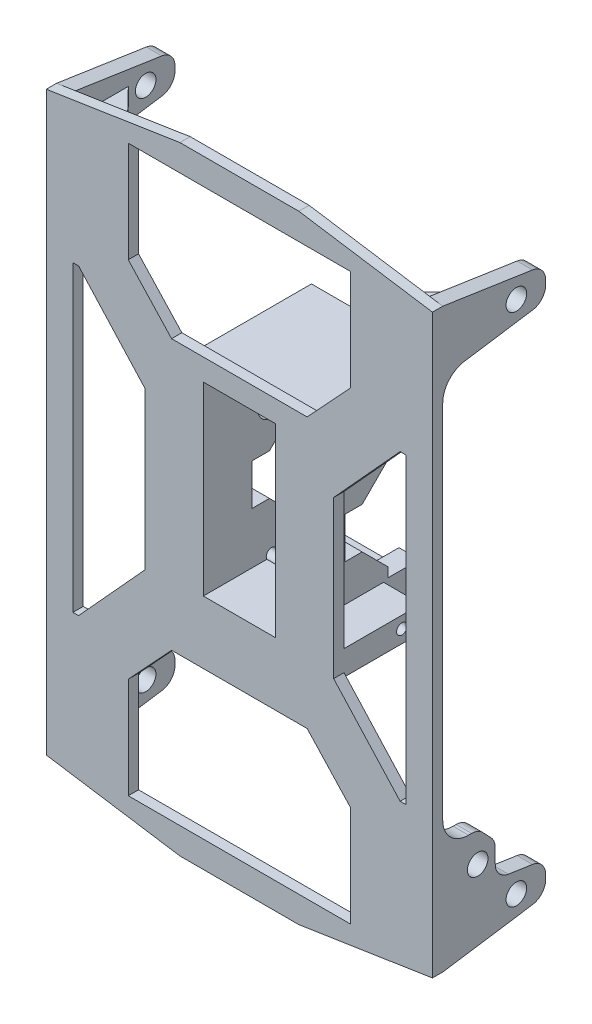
from build123d import *

# Parameters (mm, degrees)
ESQUISSE1_W              = 75
ESQUISSE1_H              = 120
BOSS_EXTRU_1_DEPTH       = 2
BOSS_EXTRU_2_DEPTH       = 3
BOSS_EXTRU_3_DEPTH       = 22
ESQUISSE5_W              = 15
ESQUISSE5_H              = 8
ENL_V_MAT_EXTRU_1_DEPTH  = 132.286899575
ESQUISSE6_R              = 2.644924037
ENL_V_MAT_EXTRU_2_DEPTH  = 22
ESQUISSE7_R              = 1.5
ENL_V_MAT_EXTRU_3_DEPTH  = 22
BOSS_EXTRU_4_DEPTH       = 3
ESQUISSE9_R              = 2
ENL_V_MAT_EXTRU_4_DEPTH  = 144.209636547
ESQUISSE10_R             = 2
ENL_V_MAT_EXTRU_5_DEPTH  = 6
ENL_V_MAT_EXTRU_6_DEPTH  = 132.286899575
BOSS_EXTRU_5_DEPTH       = 1.5
BOSS_EXTRU_6_DEPTH       = 1.5
CONG_1_R                 = 5
ENL_V_MAT_EXTRU_7_DEPTH  = 3
ESQUISSE15_W             = 14
ESQUISSE15_H             = 36
ENL_V_MAT_EXTRU_8_DEPTH  = 128.99316388
CHANFREIN1_SIZE          = 5
ESQUISSE16_W             = 7.311306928
ESQUISSE16_H             = 4.807615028
BOSS_EXTRU_7_DEPTH       = 15
ESQUISSE18_R             = 1.03
ENL_V_MAT_EXTRU_9_DEPTH  = 135.159986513
CONG_2_R                 = 3
ENL_V_MAT_EXTRU_10_DEPTH = 128.633263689
BOSS_EXTRU_8_DEPTH       = 1


with BuildPart() as part:
    # Esquisse1 → Boss.-Extru.1 (new body)
    with BuildSketch(Plane.XY):
        with Locations((0, 60)):
            Rectangle(ESQUISSE1_W, ESQUISSE1_H)
    extrude(amount=BOSS_EXTRU_1_DEPTH)

    # Esquisse2 → Boss.-Extru.2 (add)
    with BuildSketch(Plane.ZY.offset(37.5)):
        Polygon((0, 116), (-20, 113), (-20, 107), (0, 104), align=None)
        Polygon((0, 16), (0, 4), (-20, 7), (-20, 13), align=None)
    boss_extru_2 = extrude(amount=-BOSS_EXTRU_2_DEPTH)

    # Esquisse4 → Boss.-Extru.3 (add)
    with BuildSketch(Plane(origin=(0, 0, 0), x_dir=(-1, 0, 0), z_dir=(0, 0, -1))):
        Polygon((11, 49), (11, 44), (-11, 44), (-11, 49), (-11, 84), (11, 84), align=None)
    extrude(amount=BOSS_EXTRU_3_DEPTH)

    # Esquisse5 → Enl_v. mat.-Extru.1 (cut, through all)
    with BuildSketch(Plane(origin=(11, 0, 0), x_dir=(0, 0, -1), z_dir=(1, 0, 0))):
        with Locations((15, 60)):
            Rectangle(ESQUISSE5_W, ESQUISSE5_H)
    extrude(amount=-ENL_V_MAT_EXTRU_1_DEPTH, mode=Mode.SUBTRACT)

    # Esquisse6 → Enl_v. mat.-Extru.2 (cut)
    with BuildSketch(Plane(origin=(11, 0, 0), x_dir=(0, 0, -1), z_dir=(1, 0, 0))):
        with Locations((11.25, 72)):
            Circle(ESQUISSE6_R)
    extrude(amount=-ENL_V_MAT_EXTRU_2_DEPTH, mode=Mode.SUBTRACT)

    # Esquisse7 → Enl_v. mat.-Extru.3 (cut)
    with BuildSketch(Plane(origin=(11, 0, 0), x_dir=(0, 0, -1), z_dir=(1, 0, 0))):
        with Locations((2.5, 80)):
            Circle(ESQUISSE7_R)
        with Locations((20, 80)):
            Circle(ESQUISSE7_R)
    extrude(amount=-ENL_V_MAT_EXTRU_3_DEPTH, mode=Mode.SUBTRACT)

    # Esquisse8 → Boss.-Extru.4 (add)
    with BuildSketch(Plane.ZY.offset(37.5)):
        Polygon((0, 24.523843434), (-6.887898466, 24.523843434), (-10.199660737, 21.050531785), (-10.199660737, 14.47005089), (0, 16), align=None)
    boss_extru_4 = extrude(amount=-BOSS_EXTRU_4_DEPTH)

    # Esquisse9 → Enl_v. mat.-Extru.4 (cut, through all)
    with BuildSketch(Plane.ZY.offset(37.5)):
        with Locations((-14.3, 110)):
            Circle(ESQUISSE9_R)
        with Locations((-14.3, 10)):
            Circle(ESQUISSE9_R)
    enl_v_mat_extru_4 = extrude(amount=-ENL_V_MAT_EXTRU_4_DEPTH, mode=Mode.SUBTRACT)

    # Esquisse10 → Enl_v. mat.-Extru.5 (cut)
    with BuildSketch(Plane.ZY.offset(37.5)):
        with Locations((-6.795438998, 18.729344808)):
            Circle(ESQUISSE10_R)
    enl_v_mat_extru_5 = extrude(amount=-ENL_V_MAT_EXTRU_5_DEPTH, mode=Mode.SUBTRACT)

    # Esquisse11 → Enl_v. mat.-Extru.6 (cut, through all)
    with BuildSketch(Plane(origin=(11, 0, 0), x_dir=(0, 0, -1), z_dir=(1, 0, 0))):
        Polygon((22, 76.257909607), (15.845764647, 76.257909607), (15.845764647, 67.006090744), (15.845764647, 49.136637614), (22, 49.136637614), align=None)
    extrude(amount=-ENL_V_MAT_EXTRU_6_DEPTH, mode=Mode.SUBTRACT)

    # Esquisse12 → Boss.-Extru.5 (add, symmetric)
    with BuildSketch(Plane(origin=(0, 110, 0), x_dir=(1, 0, 0), z_dir=(0, 1, 0))):
        Polygon((-34.5, 10.932504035), (-23.876971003, 0), (-34.5, 0), align=None)
    boss_extru_5 = extrude(amount=BOSS_EXTRU_5_DEPTH, both=True)

    # Esquisse13 → Boss.-Extru.6 (add, symmetric)
    with BuildSketch(Plane(origin=(0, 10, 0), x_dir=(-1, 0, 0), z_dir=(0, -1, 0))):
        Polygon((34.5, 0), (34.5, 10.932504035), (23.876971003, 0), align=None)
    boss_extru_6 = extrude(amount=BOSS_EXTRU_6_DEPTH, both=True)

    # Sym_trie1: Boss.-Extru.2, Boss.-Extru.4, Enl_v. mat.-Extru.4, Enl_v. mat.-Extru.5, Boss.-Extru.5, Boss.-Extru.6 across plane
    add(boss_extru_2.mirror(Plane(origin=(0, 0, 0), x_dir=(0, 0, 1), z_dir=(1, 0, 0))))
    add(boss_extru_4.mirror(Plane(origin=(0, 0, 0), x_dir=(0, 0, 1), z_dir=(1, 0, 0))))
    add(enl_v_mat_extru_4.mirror(Plane(origin=(0, 0, 0), x_dir=(0, 0, 1), z_dir=(1, 0, 0))), mode=Mode.SUBTRACT)
    add(enl_v_mat_extru_5.mirror(Plane(origin=(0, 0, 0), x_dir=(0, 0, 1), z_dir=(1, 0, 0))), mode=Mode.SUBTRACT)
    add(boss_extru_5.mirror(Plane(origin=(0, 0, 0), x_dir=(0, 0, 1), z_dir=(1, 0, 0))))
    add(boss_extru_6.mirror(Plane(origin=(0, 0, 0), x_dir=(0, 0, 1), z_dir=(1, 0, 0))))

    # Cong_1
    cong_1_edges = [part.edges().sort_by_distance(p)[0] for p in [
        (-36, 104, 0),
        (36, 104, 0),
        (36, 24.523843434, 0),
        (-36, 24.523843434, 0),
    ]]
    fillet(cong_1_edges, radius=CONG_1_R)

    # Esquisse14 → Enl_v. mat.-Extru.7 (cut)
    with BuildSketch(Plane(origin=(0, 0, 0), x_dir=(-1, 0, 0), z_dir=(0, 0, -1))):
        Polygon((21.57949853, 114.885851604), (-21.57949853, 114.885851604), (-21.57949853, 95.275999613), (-13.167865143, 86.204630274), (13.167865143, 86.204630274), (21.57949853, 95.275999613), align=None)
        Polygon((21.57949853, 5.114148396), (21.57949853, 24.724000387), (13.167865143, 33.795369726), (-13.167865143, 33.795369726), (-21.57949853, 24.724000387), (-21.57949853, 5.114148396), align=None)
        Polygon((-18.311306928, 75.234069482), (-31.224089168, 89.406635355), (-32.324600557, 89.406635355), (-32.324600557, 30.593364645), (-31.224089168, 30.593364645), (-18.311306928, 44.765930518), align=None)
        Polygon((31.224089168, 30.593364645), (32.324600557, 30.593364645), (32.324600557, 89.406635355), (31.224089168, 89.406635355), (18.311306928, 75.234069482), (18.311306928, 44.765930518), align=None)
    extrude(amount=-ENL_V_MAT_EXTRU_7_DEPTH, mode=Mode.SUBTRACT)

    # Esquisse15 → Enl_v. mat.-Extru.8 (cut, through all)
    with BuildSketch(Plane(origin=(0, 0, -22), x_dir=(-1, 0, 0), z_dir=(0, 0, -1))):
        with Locations((0, 64)):
            Rectangle(ESQUISSE15_W, ESQUISSE15_H)
    extrude(amount=-ENL_V_MAT_EXTRU_8_DEPTH, mode=Mode.SUBTRACT)

    # Chanfrein1
    chanfrein1_edges = [part.edges().sort_by_distance(p)[0] for p in [
        (-9, 64, -15.845764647),
        (9, 56, -15.845764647),
        (-9, 56, -15.845764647),
        (9, 64, -15.845764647),
    ]]
    chamfer(chanfrein1_edges, length=CHANFREIN1_SIZE)

    # Esquisse16 → Boss.-Extru.7 (add)
    with BuildSketch(Plane(origin=(0, 0, 0), x_dir=(-1, 0, 0), z_dir=(0, 0, -1))):
        with Locations((14.655653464, 46.403807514)):
            Rectangle(ESQUISSE16_W, ESQUISSE16_H)
        with Locations((-14.655653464, 46.403807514)):
            Rectangle(ESQUISSE16_W, ESQUISSE16_H)
    extrude(amount=BOSS_EXTRU_7_DEPTH)

    # Esquisse18 → Enl_v. mat.-Extru.9 (cut, through all)
    with BuildSketch(Plane(origin=(18.311306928, 0, 0), x_dir=(0, 0, -1), z_dir=(1, 0, 0))):
        with Locations((11.25, 46.5)):
            Circle(ESQUISSE18_R)
    extrude(amount=-ENL_V_MAT_EXTRU_9_DEPTH, mode=Mode.SUBTRACT)

    # Cong_2
    cong_2_edges = [part.edges().sort_by_distance(p)[0] for p in [
        (-36, 107, -20),
        (-36, 113, -20),
        (36, 113, -20),
        (36, 107, -20),
        (36, 13, -20),
        (36, 7, -20),
        (36, 24.523843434, -6.887898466),
        (36, 21.050531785, -10.199660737),
        (36, 14.47005089, -10.199660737),
        (-36, 13, -20),
        (-36, 7, -20),
        (-36, 14.47005089, -10.199660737),
        (-36, 21.050531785, -10.199660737),
        (-36, 24.523843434, -6.887898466),
    ]]
    fillet(cong_2_edges, radius=CONG_2_R)

    # Esquisse19 → Enl_v. mat.-Extru.10 (cut, through all)
    with BuildSketch(Plane(origin=(0, 0, 0), x_dir=(-1, 0, 0), z_dir=(0, 0, -1))):
        Polygon((-37.5, 116), (-11.545314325, 120), (-37.5, 120), align=None)
        Polygon((37.5, 120), (37.5, 116), (11.545314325, 120), align=None)
        Polygon((37.5, 4), (11.545314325, 0), (37.5, 0), align=None)
        Polygon((-37.5, 0), (-37.5, 4), (-11.545314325, 0), align=None)
    extrude(amount=-ENL_V_MAT_EXTRU_10_DEPTH, mode=Mode.SUBTRACT)

    # Esquisse20 → Boss.-Extru.8 (add)
    with BuildSketch(Plane(origin=(0, 0, -22), x_dir=(-1, 0, 0), z_dir=(0, 0, -1))):
        Polygon((-11, 76.257909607), (-7, 76.257909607), (-7, 82), (7, 82), (7, 76.257909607), (11, 76.257909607), (11, 84), (-11, 84), align=None)
    extrude(amount=BOSS_EXTRU_8_DEPTH)


solid = part.part
